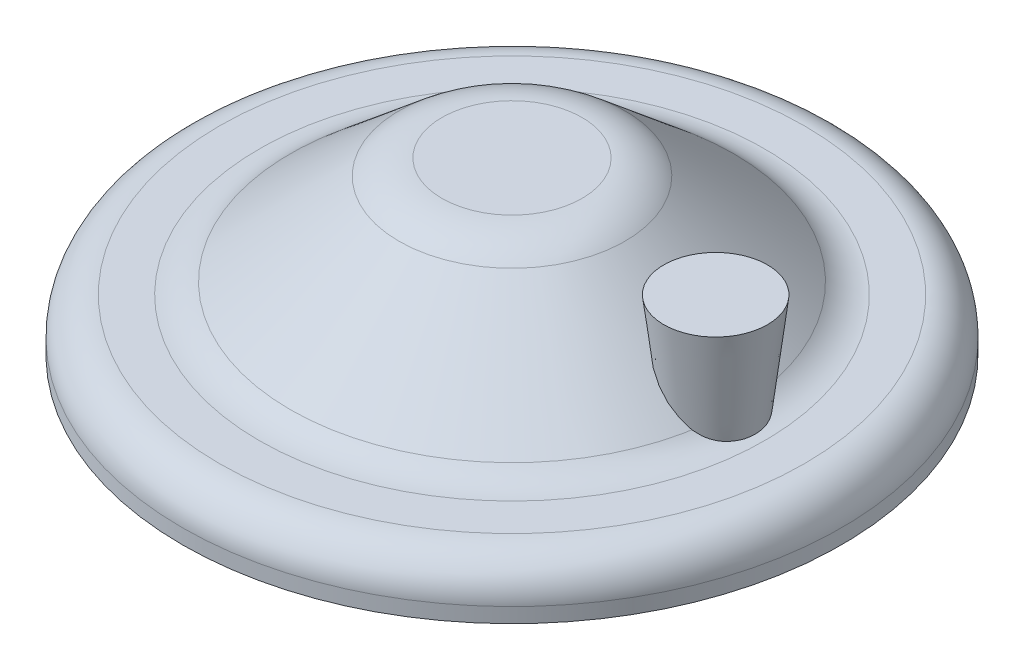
ISO-10303-21;
HEADER;
FILE_DESCRIPTION(('STEP AP214'),'2;1');
FILE_NAME('part.step','',(''),(''),'','','');
FILE_SCHEMA(('AUTOMOTIVE_DESIGN { 1 0 10303 214 1 1 1 1 }'));
ENDSEC;
DATA;
#1=APPLICATION_CONTEXT('core data for automotive mechanical design processes');
#2=APPLICATION_PROTOCOL_DEFINITION('international standard','automotive_design',2000,#1);
#3=PRODUCT_CONTEXT('',#1,'mechanical');
#4=PRODUCT('Part','Part','',(#3));
#5=PRODUCT_RELATED_PRODUCT_CATEGORY('part','',(#4));
#6=PRODUCT_DEFINITION_FORMATION('','',#4);
#7=PRODUCT_DEFINITION_CONTEXT('part definition',#1,'design');
#8=PRODUCT_DEFINITION('design','',#6,#7);
#9=PRODUCT_DEFINITION_SHAPE('','',#8);
#10=(LENGTH_UNIT() NAMED_UNIT(*) SI_UNIT(.MILLI.,.METRE.));
#11=(NAMED_UNIT(*) PLANE_ANGLE_UNIT() SI_UNIT($,.RADIAN.));
#12=(NAMED_UNIT(*) SI_UNIT($,.STERADIAN.) SOLID_ANGLE_UNIT());
#13=UNCERTAINTY_MEASURE_WITH_UNIT(LENGTH_MEASURE(1.E-05),#10,'distance_accuracy_value','');
#14=(GEOMETRIC_REPRESENTATION_CONTEXT(3) GLOBAL_UNCERTAINTY_ASSIGNED_CONTEXT((#13)) GLOBAL_UNIT_ASSIGNED_CONTEXT((#10,
#11,#12)) REPRESENTATION_CONTEXT('',''));
#15=CARTESIAN_POINT('',(0.,0.,0.));
#16=DIRECTION('',(0.,0.,1.));
#17=DIRECTION('',(1.,0.,0.));
#18=AXIS2_PLACEMENT_3D('',#15,#16,#17);
#19=CARTESIAN_POINT('',(55.,27.5,0.));
#20=DIRECTION('',(0.,1.,0.));
#21=DIRECTION('',(-1.,0.,0.));
#22=AXIS2_PLACEMENT_3D('',#19,#20,#21);
#23=CONICAL_SURFACE('',#22,14.,0.120108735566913);
#24=CARTESIAN_POINT('',(55.,-0.79585612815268,0.));
#25=DIRECTION('',(0.,-1.,0.));
#26=DIRECTION('',(1.,0.,0.));
#27=AXIS2_PLACEMENT_3D('',#24,#25,#26);
#28=CIRCLE('',#27,10.584982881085);
#29=CARTESIAN_POINT('',(65.584982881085,-0.795856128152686,0.));
#30=VERTEX_POINT('',#29);
#31=EDGE_CURVE('E11',#30,#30,#28,.F.);
#32=ORIENTED_EDGE('',*,*,#31,.T.);
#33=EDGE_LOOP('',(#32));
#34=FACE_BOUND('',#33,.T.);
#35=CARTESIAN_POINT('',(55.,27.5,0.));
#36=DIRECTION('',(0.,-1.,0.));
#37=DIRECTION('',(1.,0.,0.));
#38=AXIS2_PLACEMENT_3D('',#35,#36,#37);
#39=CIRCLE('',#38,14.);
#40=CARTESIAN_POINT('',(69.,27.5,0.));
#41=VERTEX_POINT('',#40);
#42=EDGE_CURVE('E56',#41,#41,#39,.T.);
#43=ORIENTED_EDGE('',*,*,#42,.T.);
#44=EDGE_LOOP('',(#43));
#45=FACE_BOUND('',#44,.T.);
#46=ADVANCED_FACE('F45',(#34,#45),#23,.T.);
#47=CARTESIAN_POINT('',(44.5,-1.5,0.));
#48=DIRECTION('',(0.,1.,0.));
#49=DIRECTION('',(-1.,0.,0.));
#50=AXIS2_PLACEMENT_3D('',#47,#48,#49);
#51=PLANE('',#50);
#52=CARTESIAN_POINT('',(55.,-1.5,0.));
#53=DIRECTION('',(0.,1.,0.));
#54=DIRECTION('',(-1.,0.,0.));
#55=AXIS2_PLACEMENT_3D('',#52,#53,#54);
#56=CIRCLE('',#55,9.79074639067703);
#57=CARTESIAN_POINT('',(45.209253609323,-1.5,0.));
#58=VERTEX_POINT('',#57);
#59=EDGE_CURVE('E52',#58,#58,#56,.F.);
#60=ORIENTED_EDGE('',*,*,#59,.T.);
#61=EDGE_LOOP('',(#60));
#62=FACE_BOUND('',#61,.T.);
#63=ADVANCED_FACE('F66',(#62),#51,.F.);
#64=CARTESIAN_POINT('',(41.,27.5,0.));
#65=DIRECTION('',(0.,-1.,0.));
#66=DIRECTION('',(1.,0.,0.));
#67=AXIS2_PLACEMENT_3D('',#64,#65,#66);
#68=PLANE('',#67);
#69=ORIENTED_EDGE('',*,*,#42,.F.);
#70=EDGE_LOOP('',(#69));
#71=FACE_BOUND('',#70,.T.);
#72=ADVANCED_FACE('F64',(#71),#68,.F.);
#73=CARTESIAN_POINT('',(55.,-0.700000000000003,0.));
#74=DIRECTION('',(0.,1.,0.));
#75=DIRECTION('',(-1.,0.,0.));
#76=AXIS2_PLACEMENT_3D('',#73,#74,#75);
#77=TOROIDAL_SURFACE('',#76,9.79074639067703,0.8);
#78=ORIENTED_EDGE('',*,*,#31,.F.);
#79=EDGE_LOOP('',(#78));
#80=FACE_BOUND('',#79,.T.);
#81=ORIENTED_EDGE('',*,*,#59,.F.);
#82=EDGE_LOOP('',(#81));
#83=FACE_BOUND('',#82,.T.);
#84=ADVANCED_FACE('F47',(#80,#83),#77,.T.);
#85=CLOSED_SHELL('',(#46,#63,#72,#84));
#86=MANIFOLD_SOLID_BREP('B2',#85);
#87=CARTESIAN_POINT('',(18.930579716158,25.65,0.));
#88=DIRECTION('',(0.,-1.,0.));
#89=DIRECTION('',(0.,0.,-1.));
#90=AXIS2_PLACEMENT_3D('',#87,#88,#89);
#91=PLANE('',#90);
#92=CARTESIAN_POINT('',(0.,25.65,0.));
#93=DIRECTION('',(0.,1.,0.));
#94=DIRECTION('',(0.,0.,1.));
#95=AXIS2_PLACEMENT_3D('',#92,#93,#94);
#96=CIRCLE('',#95,18.930579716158);
#97=CARTESIAN_POINT('',(0.,25.65,18.930579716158));
#98=VERTEX_POINT('',#97);
#99=EDGE_CURVE('E44',#98,#98,#96,.T.);
#100=ORIENTED_EDGE('',*,*,#99,.F.);
#101=EDGE_LOOP('',(#100));
#102=FACE_BOUND('',#101,.T.);
#103=ADVANCED_FACE('F101',(#102),#91,.T.);
#104=CARTESIAN_POINT('',(0.,14.,0.));
#105=DIRECTION('',(0.,1.,0.));
#106=DIRECTION('',(0.,0.,1.));
#107=AXIS2_PLACEMENT_3D('',#104,#105,#106);
#108=TOROIDAL_SURFACE('',#107,18.930579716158,11.65);
#109=ORIENTED_EDGE('',*,*,#99,.T.);
#110=EDGE_LOOP('',(#109));
#111=FACE_BOUND('',#110,.T.);
#112=CARTESIAN_POINT('',(0.,22.9112154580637,0.));
#113=DIRECTION('',(0.,1.,0.));
#114=DIRECTION('',(0.,0.,1.));
#115=AXIS2_PLACEMENT_3D('',#112,#113,#114);
#116=CIRCLE('',#115,26.4347611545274);
#117=CARTESIAN_POINT('',(0.,22.9112154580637,26.4347611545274));
#118=VERTEX_POINT('',#117);
#119=EDGE_CURVE('E107',#118,#118,#116,.T.);
#120=ORIENTED_EDGE('',*,*,#119,.F.);
#121=EDGE_LOOP('',(#120));
#122=FACE_BOUND('',#121,.T.);
#123=ADVANCED_FACE('F207',(#111,#122),#108,.F.);
#124=CARTESIAN_POINT('',(0.,-1.80103168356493,0.));
#125=DIRECTION('',(0.,-1.,0.));
#126=DIRECTION('',(0.,0.,-1.));
#127=AXIS2_PLACEMENT_3D('',#124,#125,#126);
#128=CONICAL_SURFACE('',#127,55.7805546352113,0.870903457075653);
#129=ORIENTED_EDGE('',*,*,#119,.T.);
#130=EDGE_LOOP('',(#129));
#131=FACE_BOUND('',#130,.T.);
#132=CARTESIAN_POINT('',(0.,-1.80103168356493,0.));
#133=DIRECTION('',(0.,1.,0.));
#134=DIRECTION('',(0.,0.,1.));
#135=AXIS2_PLACEMENT_3D('',#132,#133,#134);
#136=CIRCLE('',#135,55.7805546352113);
#137=CARTESIAN_POINT('',(0.,-1.80103168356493,55.7805546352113));
#138=VERTEX_POINT('',#137);
#139=EDGE_CURVE('E111',#138,#138,#136,.T.);
#140=ORIENTED_EDGE('',*,*,#139,.F.);
#141=EDGE_LOOP('',(#140));
#142=FACE_BOUND('',#141,.T.);
#143=ADVANCED_FACE('F212',(#131,#142),#128,.F.);
#144=CARTESIAN_POINT('',(0.,13.,0.));
#145=DIRECTION('',(0.,1.,0.));
#146=DIRECTION('',(0.,0.,1.));
#147=AXIS2_PLACEMENT_3D('',#144,#145,#146);
#148=TOROIDAL_SURFACE('',#147,68.2445813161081,19.35);
#149=ORIENTED_EDGE('',*,*,#139,.T.);
#150=EDGE_LOOP('',(#149));
#151=FACE_BOUND('',#150,.T.);
#152=CARTESIAN_POINT('',(0.,-6.34999999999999,0.));
#153=DIRECTION('',(0.,1.,0.));
#154=DIRECTION('',(0.,0.,1.));
#155=AXIS2_PLACEMENT_3D('',#152,#153,#154);
#156=CIRCLE('',#155,68.2445813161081);
#157=CARTESIAN_POINT('',(0.,-6.34999999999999,68.2445813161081));
#158=VERTEX_POINT('',#157);
#159=EDGE_CURVE('E115',#158,#158,#156,.T.);
#160=ORIENTED_EDGE('',*,*,#159,.F.);
#161=EDGE_LOOP('',(#160));
#162=FACE_BOUND('',#161,.T.);
#163=ADVANCED_FACE('F216',(#151,#162),#148,.T.);
#164=CARTESIAN_POINT('',(79.,-6.35,0.));
#165=DIRECTION('',(0.,-1.,0.));
#166=DIRECTION('',(0.,0.,-1.));
#167=AXIS2_PLACEMENT_3D('',#164,#165,#166);
#168=PLANE('',#167);
#169=ORIENTED_EDGE('',*,*,#159,.T.);
#170=EDGE_LOOP('',(#169));
#171=FACE_BOUND('',#170,.T.);
#172=CARTESIAN_POINT('',(0.,-6.35,0.));
#173=DIRECTION('',(0.,1.,0.));
#174=DIRECTION('',(0.,0.,1.));
#175=AXIS2_PLACEMENT_3D('',#172,#173,#174);
#176=CIRCLE('',#175,79.);
#177=CARTESIAN_POINT('',(0.,-6.35,79.));
#178=VERTEX_POINT('',#177);
#179=EDGE_CURVE('E120',#178,#178,#176,.T.);
#180=ORIENTED_EDGE('',*,*,#179,.F.);
#181=EDGE_LOOP('',(#180));
#182=FACE_BOUND('',#181,.T.);
#183=ADVANCED_FACE('F203',(#171,#182),#168,.T.);
#184=CARTESIAN_POINT('',(0.,-10.,0.));
#185=DIRECTION('',(0.,1.,0.));
#186=DIRECTION('',(0.,0.,1.));
#187=AXIS2_PLACEMENT_3D('',#184,#185,#186);
#188=TOROIDAL_SURFACE('',#187,79.,3.64999999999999);
#189=ORIENTED_EDGE('',*,*,#179,.T.);
#190=EDGE_LOOP('',(#189));
#191=FACE_BOUND('',#190,.T.);
#192=CARTESIAN_POINT('',(0.,-10.,0.));
#193=DIRECTION('',(0.,1.,0.));
#194=DIRECTION('',(0.,0.,1.));
#195=AXIS2_PLACEMENT_3D('',#192,#193,#194);
#196=CIRCLE('',#195,82.65);
#197=CARTESIAN_POINT('',(0.,-10.,82.65));
#198=VERTEX_POINT('',#197);
#199=EDGE_CURVE('E123',#198,#198,#196,.T.);
#200=ORIENTED_EDGE('',*,*,#199,.F.);
#201=EDGE_LOOP('',(#200));
#202=FACE_BOUND('',#201,.T.);
#203=ADVANCED_FACE('F197',(#191,#202),#188,.F.);
#204=CARTESIAN_POINT('',(0.,32.,0.));
#205=DIRECTION('',(0.,1.,0.));
#206=DIRECTION('',(0.,0.,1.));
#207=AXIS2_PLACEMENT_3D('',#204,#205,#206);
#208=CYLINDRICAL_SURFACE('',#207,82.65);
#209=ORIENTED_EDGE('',*,*,#199,.T.);
#210=EDGE_LOOP('',(#209));
#211=FACE_BOUND('',#210,.T.);
#212=CARTESIAN_POINT('',(0.,-14.,0.));
#213=DIRECTION('',(0.,1.,0.));
#214=DIRECTION('',(0.,0.,1.));
#215=AXIS2_PLACEMENT_3D('',#212,#213,#214);
#216=CIRCLE('',#215,82.65);
#217=CARTESIAN_POINT('',(0.,-14.,82.65));
#218=VERTEX_POINT('',#217);
#219=EDGE_CURVE('E126',#218,#218,#216,.T.);
#220=ORIENTED_EDGE('',*,*,#219,.F.);
#221=EDGE_LOOP('',(#220));
#222=FACE_BOUND('',#221,.T.);
#223=ADVANCED_FACE('F192',(#211,#222),#208,.F.);
#224=CARTESIAN_POINT('',(82.65,-14.,0.));
#225=DIRECTION('',(0.,1.,0.));
#226=DIRECTION('',(0.,0.,1.));
#227=AXIS2_PLACEMENT_3D('',#224,#225,#226);
#228=PLANE('',#227);
#229=CARTESIAN_POINT('',(0.,-14.,0.));
#230=DIRECTION('',(0.,1.,0.));
#231=DIRECTION('',(0.,0.,1.));
#232=AXIS2_PLACEMENT_3D('',#229,#230,#231);
#233=CIRCLE('',#232,89.);
#234=CARTESIAN_POINT('',(0.,-14.,89.));
#235=VERTEX_POINT('',#234);
#236=EDGE_CURVE('E129',#235,#235,#233,.T.);
#237=ORIENTED_EDGE('',*,*,#236,.F.);
#238=EDGE_LOOP('',(#237));
#239=FACE_BOUND('',#238,.T.);
#240=ORIENTED_EDGE('',*,*,#219,.T.);
#241=EDGE_LOOP('',(#240));
#242=FACE_BOUND('',#241,.T.);
#243=ADVANCED_FACE('F186',(#239,#242),#228,.F.);
#244=CARTESIAN_POINT('',(0.,32.,0.));
#245=DIRECTION('',(0.,1.,0.));
#246=DIRECTION('',(0.,0.,1.));
#247=AXIS2_PLACEMENT_3D('',#244,#245,#246);
#248=CYLINDRICAL_SURFACE('',#247,89.);
#249=CARTESIAN_POINT('',(0.,-10.,0.));
#250=DIRECTION('',(0.,1.,0.));
#251=DIRECTION('',(0.,0.,1.));
#252=AXIS2_PLACEMENT_3D('',#249,#250,#251);
#253=CIRCLE('',#252,89.);
#254=CARTESIAN_POINT('',(0.,-10.,89.));
#255=VERTEX_POINT('',#254);
#256=EDGE_CURVE('E132',#255,#255,#253,.T.);
#257=ORIENTED_EDGE('',*,*,#256,.F.);
#258=EDGE_LOOP('',(#257));
#259=FACE_BOUND('',#258,.T.);
#260=ORIENTED_EDGE('',*,*,#236,.T.);
#261=EDGE_LOOP('',(#260));
#262=FACE_BOUND('',#261,.T.);
#263=ADVANCED_FACE('F180',(#259,#262),#248,.T.);
#264=CARTESIAN_POINT('',(0.,-10.,0.));
#265=DIRECTION('',(0.,1.,0.));
#266=DIRECTION('',(0.,0.,1.));
#267=AXIS2_PLACEMENT_3D('',#264,#265,#266);
#268=TOROIDAL_SURFACE('',#267,79.,9.99999999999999);
#269=CARTESIAN_POINT('',(0.,0.,0.));
#270=DIRECTION('',(0.,1.,0.));
#271=DIRECTION('',(0.,0.,1.));
#272=AXIS2_PLACEMENT_3D('',#269,#270,#271);
#273=CIRCLE('',#272,79.);
#274=CARTESIAN_POINT('',(0.,0.,79.));
#275=VERTEX_POINT('',#274);
#276=EDGE_CURVE('E135',#275,#275,#273,.T.);
#277=ORIENTED_EDGE('',*,*,#276,.F.);
#278=EDGE_LOOP('',(#277));
#279=FACE_BOUND('',#278,.T.);
#280=ORIENTED_EDGE('',*,*,#256,.T.);
#281=EDGE_LOOP('',(#280));
#282=FACE_BOUND('',#281,.T.);
#283=ADVANCED_FACE('F174',(#279,#282),#268,.T.);
#284=CARTESIAN_POINT('',(79.,0.,0.));
#285=DIRECTION('',(0.,-1.,0.));
#286=DIRECTION('',(0.,0.,-1.));
#287=AXIS2_PLACEMENT_3D('',#284,#285,#286);
#288=PLANE('',#287);
#289=CARTESIAN_POINT('',(0.,0.,0.));
#290=DIRECTION('',(0.,1.,0.));
#291=DIRECTION('',(0.,0.,1.));
#292=AXIS2_PLACEMENT_3D('',#289,#290,#291);
#293=CIRCLE('',#292,68.2445813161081);
#294=CARTESIAN_POINT('',(0.,0.,68.2445813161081));
#295=VERTEX_POINT('',#294);
#296=EDGE_CURVE('E138',#295,#295,#293,.T.);
#297=ORIENTED_EDGE('',*,*,#296,.F.);
#298=EDGE_LOOP('',(#297));
#299=FACE_BOUND('',#298,.T.);
#300=ORIENTED_EDGE('',*,*,#276,.T.);
#301=EDGE_LOOP('',(#300));
#302=FACE_BOUND('',#301,.T.);
#303=ADVANCED_FACE('F168',(#299,#302),#288,.F.);
#304=CARTESIAN_POINT('',(0.,13.,0.));
#305=DIRECTION('',(0.,1.,0.));
#306=DIRECTION('',(0.,0.,1.));
#307=AXIS2_PLACEMENT_3D('',#304,#305,#306);
#308=TOROIDAL_SURFACE('',#307,68.2445813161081,13.);
#309=CARTESIAN_POINT('',(0.,3.05615442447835,0.));
#310=DIRECTION('',(0.,1.,0.));
#311=DIRECTION('',(0.,0.,1.));
#312=AXIS2_PLACEMENT_3D('',#309,#310,#311);
#313=CIRCLE('',#312,59.870816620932);
#314=CARTESIAN_POINT('',(0.,3.05615442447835,59.870816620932));
#315=VERTEX_POINT('',#314);
#316=EDGE_CURVE('E141',#315,#315,#313,.T.);
#317=ORIENTED_EDGE('',*,*,#316,.F.);
#318=EDGE_LOOP('',(#317));
#319=FACE_BOUND('',#318,.T.);
#320=ORIENTED_EDGE('',*,*,#296,.T.);
#321=EDGE_LOOP('',(#320));
#322=FACE_BOUND('',#321,.T.);
#323=ADVANCED_FACE('F162',(#319,#322),#308,.F.);
#324=CARTESIAN_POINT('',(0.,3.05615442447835,0.));
#325=DIRECTION('',(0.,-1.,0.));
#326=DIRECTION('',(0.,0.,-1.));
#327=AXIS2_PLACEMENT_3D('',#324,#325,#326);
#328=CONICAL_SURFACE('',#327,59.870816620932,0.870903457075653);
#329=CARTESIAN_POINT('',(0.,27.7684015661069,0.));
#330=DIRECTION('',(0.,1.,0.));
#331=DIRECTION('',(0.,0.,1.));
#332=AXIS2_PLACEMENT_3D('',#329,#330,#331);
#333=CIRCLE('',#332,30.525023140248);
#334=CARTESIAN_POINT('',(0.,27.7684015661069,30.525023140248));
#335=VERTEX_POINT('',#334);
#336=EDGE_CURVE('E144',#335,#335,#333,.T.);
#337=ORIENTED_EDGE('',*,*,#336,.F.);
#338=EDGE_LOOP('',(#337));
#339=FACE_BOUND('',#338,.T.);
#340=ORIENTED_EDGE('',*,*,#316,.T.);
#341=EDGE_LOOP('',(#340));
#342=FACE_BOUND('',#341,.T.);
#343=ADVANCED_FACE('F156',(#339,#342),#328,.T.);
#344=CARTESIAN_POINT('',(0.,14.,0.));
#345=DIRECTION('',(0.,1.,0.));
#346=DIRECTION('',(0.,0.,1.));
#347=AXIS2_PLACEMENT_3D('',#344,#345,#346);
#348=TOROIDAL_SURFACE('',#347,18.930579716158,18.);
#349=CARTESIAN_POINT('',(0.,32.,0.));
#350=DIRECTION('',(0.,1.,0.));
#351=DIRECTION('',(0.,0.,1.));
#352=AXIS2_PLACEMENT_3D('',#349,#350,#351);
#353=CIRCLE('',#352,18.930579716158);
#354=CARTESIAN_POINT('',(0.,32.,18.930579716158));
#355=VERTEX_POINT('',#354);
#356=EDGE_CURVE('E147',#355,#355,#353,.T.);
#357=ORIENTED_EDGE('',*,*,#356,.F.);
#358=EDGE_LOOP('',(#357));
#359=FACE_BOUND('',#358,.T.);
#360=ORIENTED_EDGE('',*,*,#336,.T.);
#361=EDGE_LOOP('',(#360));
#362=FACE_BOUND('',#361,.T.);
#363=ADVANCED_FACE('F153',(#359,#362),#348,.T.);
#364=CARTESIAN_POINT('',(18.930579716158,32.,0.));
#365=DIRECTION('',(0.,-1.,0.));
#366=DIRECTION('',(0.,0.,-1.));
#367=AXIS2_PLACEMENT_3D('',#364,#365,#366);
#368=PLANE('',#367);
#369=ORIENTED_EDGE('',*,*,#356,.T.);
#370=EDGE_LOOP('',(#369));
#371=FACE_BOUND('',#370,.T.);
#372=ADVANCED_FACE('F151',(#371),#368,.F.);
#373=CLOSED_SHELL('',(#103,#123,#143,#163,#183,#203,#223,#243,#263,#283,#303,#323,#343,#363,#372));
#374=MANIFOLD_SOLID_BREP('B6',#373);
#375=ADVANCED_BREP_SHAPE_REPRESENTATION('',(#18,#86,#374),#14);
#376=SHAPE_DEFINITION_REPRESENTATION(#9,#375);
ENDSEC;
END-ISO-10303-21;
